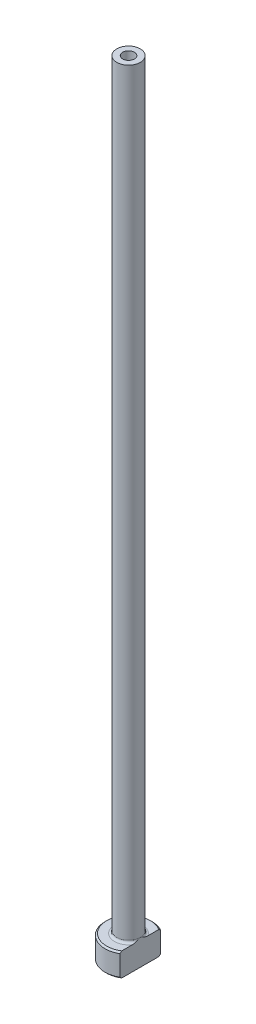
ISO-10303-21;
HEADER;
FILE_DESCRIPTION(('STEP AP214'),'2;1');
FILE_NAME('part.step','',(''),(''),'','','');
FILE_SCHEMA(('AUTOMOTIVE_DESIGN { 1 0 10303 214 1 1 1 1 }'));
ENDSEC;
DATA;
#1=APPLICATION_CONTEXT('core data for automotive mechanical design processes');
#2=APPLICATION_PROTOCOL_DEFINITION('international standard','automotive_design',2000,#1);
#3=PRODUCT_CONTEXT('',#1,'mechanical');
#4=PRODUCT('Part','Part','',(#3));
#5=PRODUCT_RELATED_PRODUCT_CATEGORY('part','',(#4));
#6=PRODUCT_DEFINITION_FORMATION('','',#4);
#7=PRODUCT_DEFINITION_CONTEXT('part definition',#1,'design');
#8=PRODUCT_DEFINITION('design','',#6,#7);
#9=PRODUCT_DEFINITION_SHAPE('','',#8);
#10=(LENGTH_UNIT() NAMED_UNIT(*) SI_UNIT(.MILLI.,.METRE.));
#11=(NAMED_UNIT(*) PLANE_ANGLE_UNIT() SI_UNIT($,.RADIAN.));
#12=(NAMED_UNIT(*) SI_UNIT($,.STERADIAN.) SOLID_ANGLE_UNIT());
#13=UNCERTAINTY_MEASURE_WITH_UNIT(LENGTH_MEASURE(1.E-05),#10,'distance_accuracy_value','');
#14=(GEOMETRIC_REPRESENTATION_CONTEXT(3) GLOBAL_UNCERTAINTY_ASSIGNED_CONTEXT((#13)) GLOBAL_UNIT_ASSIGNED_CONTEXT((#10,
#11,#12)) REPRESENTATION_CONTEXT('',''));
#15=CARTESIAN_POINT('',(0.,0.,0.));
#16=DIRECTION('',(0.,0.,1.));
#17=DIRECTION('',(1.,0.,0.));
#18=AXIS2_PLACEMENT_3D('',#15,#16,#17);
#19=CARTESIAN_POINT('',(0.,92.1876809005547,0.));
#20=DIRECTION('',(0.,1.,0.));
#21=DIRECTION('',(0.,0.,1.));
#22=AXIS2_PLACEMENT_3D('',#19,#20,#21);
#23=CYLINDRICAL_SURFACE('',#22,0.750000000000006);
#24=CARTESIAN_POINT('',(0.,100.,0.));
#25=DIRECTION('',(0.,1.,0.));
#26=DIRECTION('',(0.,0.,1.));
#27=AXIS2_PLACEMENT_3D('',#24,#25,#26);
#28=CIRCLE('',#27,0.750000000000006);
#29=CARTESIAN_POINT('',(0.,100.,0.750000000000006));
#30=VERTEX_POINT('',#29);
#31=EDGE_CURVE('E172',#30,#30,#28,.T.);
#32=ORIENTED_EDGE('',*,*,#31,.T.);
#33=EDGE_LOOP('',(#32));
#34=FACE_BOUND('',#33,.T.);
#35=CARTESIAN_POINT('',(0.,65.,0.));
#36=DIRECTION('',(0.,1.,0.));
#37=DIRECTION('',(0.,0.,1.));
#38=AXIS2_PLACEMENT_3D('',#35,#36,#37);
#39=CIRCLE('',#38,0.750000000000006);
#40=CARTESIAN_POINT('',(0.,65.,0.750000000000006));
#41=VERTEX_POINT('',#40);
#42=EDGE_CURVE('E175',#41,#41,#39,.T.);
#43=ORIENTED_EDGE('',*,*,#42,.F.);
#44=EDGE_LOOP('',(#43));
#45=FACE_BOUND('',#44,.T.);
#46=ADVANCED_FACE('F32',(#34,#45),#23,.F.);
#47=CARTESIAN_POINT('',(-0.750000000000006,100.,0.));
#48=DIRECTION('',(0.,1.,0.));
#49=DIRECTION('',(0.,0.,1.));
#50=AXIS2_PLACEMENT_3D('',#47,#48,#49);
#51=PLANE('',#50);
#52=CARTESIAN_POINT('',(0.,100.,0.));
#53=DIRECTION('',(0.,1.,0.));
#54=DIRECTION('',(0.,0.,1.));
#55=AXIS2_PLACEMENT_3D('',#52,#53,#54);
#56=CIRCLE('',#55,1.5);
#57=CARTESIAN_POINT('',(0.,100.,1.5));
#58=VERTEX_POINT('',#57);
#59=EDGE_CURVE('E179',#58,#58,#56,.T.);
#60=ORIENTED_EDGE('',*,*,#59,.T.);
#61=EDGE_LOOP('',(#60));
#62=FACE_BOUND('',#61,.T.);
#63=ORIENTED_EDGE('',*,*,#31,.F.);
#64=EDGE_LOOP('',(#63));
#65=FACE_BOUND('',#64,.T.);
#66=ADVANCED_FACE('F162',(#62,#65),#51,.T.);
#67=CARTESIAN_POINT('',(0.,92.1876809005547,0.));
#68=DIRECTION('',(0.,1.,0.));
#69=DIRECTION('',(0.,0.,1.));
#70=AXIS2_PLACEMENT_3D('',#67,#68,#69);
#71=CYLINDRICAL_SURFACE('',#70,1.49999999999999);
#72=CARTESIAN_POINT('',(0.,3.3,0.));
#73=DIRECTION('',(0.,1.,0.));
#74=DIRECTION('',(0.,0.,1.));
#75=AXIS2_PLACEMENT_3D('',#72,#73,#74);
#76=CIRCLE('',#75,1.49999999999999);
#77=CARTESIAN_POINT('',(1.49999999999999,3.3,0.));
#78=VERTEX_POINT('',#77);
#79=EDGE_CURVE('E187',#78,#78,#76,.T.);
#80=ORIENTED_EDGE('',*,*,#79,.T.);
#81=EDGE_LOOP('',(#80));
#82=FACE_BOUND('',#81,.T.);
#83=ORIENTED_EDGE('',*,*,#59,.F.);
#84=EDGE_LOOP('',(#83));
#85=FACE_BOUND('',#84,.T.);
#86=ADVANCED_FACE('F167',(#82,#85),#71,.T.);
#87=CARTESIAN_POINT('',(-1.49999999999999,3.,0.));
#88=DIRECTION('',(0.,1.,0.));
#89=DIRECTION('',(0.,0.,1.));
#90=AXIS2_PLACEMENT_3D('',#87,#88,#89);
#91=PLANE('',#90);
#92=DIRECTION('',(0.,0.,1.));
#93=VECTOR('',#92,1.);
#94=CARTESIAN_POINT('',(1.5,3.,0.));
#95=LINE('',#94,#93);
#96=CARTESIAN_POINT('',(1.5,3.,-2.36431808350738));
#97=VERTEX_POINT('',#96);
#98=CARTESIAN_POINT('',(1.5,3.,-0.994987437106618));
#99=VERTEX_POINT('',#98);
#100=EDGE_CURVE('E182',#97,#99,#95,.T.);
#101=ORIENTED_EDGE('',*,*,#100,.F.);
#102=CARTESIAN_POINT('',(0.,3.,0.));
#103=DIRECTION('',(0.,1.,0.));
#104=DIRECTION('',(0.,0.,1.));
#105=AXIS2_PLACEMENT_3D('',#102,#103,#104);
#106=CIRCLE('',#105,2.8);
#107=CARTESIAN_POINT('',(1.49999999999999,2.99999999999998,2.36431808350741));
#108=VERTEX_POINT('',#107);
#109=EDGE_CURVE('E193',#97,#108,#106,.T.);
#110=ORIENTED_EDGE('',*,*,#109,.T.);
#111=CARTESIAN_POINT('',(1.5,3.,0.994987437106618));
#112=VERTEX_POINT('',#111);
#113=EDGE_CURVE('E139',#112,#108,#95,.T.);
#114=ORIENTED_EDGE('',*,*,#113,.F.);
#115=CARTESIAN_POINT('',(0.,3.,0.));
#116=DIRECTION('',(0.,1.,0.));
#117=DIRECTION('',(0.,0.,1.));
#118=AXIS2_PLACEMENT_3D('',#115,#116,#117);
#119=CIRCLE('',#118,1.79999999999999);
#120=EDGE_CURVE('E190',#112,#99,#119,.F.);
#121=ORIENTED_EDGE('',*,*,#120,.T.);
#122=EDGE_LOOP('',(#101,#110,#114,#121));
#123=FACE_BOUND('',#122,.T.);
#124=ADVANCED_FACE('F208',(#123),#91,.T.);
#125=CARTESIAN_POINT('',(0.,92.1876809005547,0.));
#126=DIRECTION('',(0.,1.,0.));
#127=DIRECTION('',(0.,0.,1.));
#128=AXIS2_PLACEMENT_3D('',#125,#126,#127);
#129=CYLINDRICAL_SURFACE('',#128,2.99999999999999);
#130=DIRECTION('',(0.,-1.,0.));
#131=VECTOR('',#130,1.);
#132=CARTESIAN_POINT('',(1.49999999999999,100.,2.59807621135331));
#133=LINE('',#132,#131);
#134=CARTESIAN_POINT('',(1.49999999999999,2.8,2.59807621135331));
#135=VERTEX_POINT('',#134);
#136=CARTESIAN_POINT('',(1.49999999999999,0.20000000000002,2.59807621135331));
#137=VERTEX_POINT('',#136);
#138=EDGE_CURVE('E87',#135,#137,#133,.T.);
#139=ORIENTED_EDGE('',*,*,#138,.F.);
#140=CARTESIAN_POINT('',(0.,2.8,0.));
#141=DIRECTION('',(0.,1.,0.));
#142=DIRECTION('',(0.,0.,1.));
#143=AXIS2_PLACEMENT_3D('',#140,#141,#142);
#144=CIRCLE('',#143,2.99999999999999);
#145=CARTESIAN_POINT('',(1.5,2.8,-2.59807621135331));
#146=VERTEX_POINT('',#145);
#147=EDGE_CURVE('E100',#135,#146,#144,.F.);
#148=ORIENTED_EDGE('',*,*,#147,.T.);
#149=DIRECTION('',(0.,-1.,0.));
#150=VECTOR('',#149,1.);
#151=CARTESIAN_POINT('',(1.5,100.,-2.59807621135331));
#152=LINE('',#151,#150);
#153=CARTESIAN_POINT('',(1.5,0.20000000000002,-2.59807621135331));
#154=VERTEX_POINT('',#153);
#155=EDGE_CURVE('E199',#146,#154,#152,.T.);
#156=ORIENTED_EDGE('',*,*,#155,.T.);
#157=CARTESIAN_POINT('',(0.,0.20000000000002,0.));
#158=DIRECTION('',(0.,-1.,0.));
#159=DIRECTION('',(0.,0.,-1.));
#160=AXIS2_PLACEMENT_3D('',#157,#158,#159);
#161=CIRCLE('',#160,2.99999999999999);
#162=EDGE_CURVE('E103',#154,#137,#161,.F.);
#163=ORIENTED_EDGE('',*,*,#162,.T.);
#164=EDGE_LOOP('',(#139,#148,#156,#163));
#165=FACE_BOUND('',#164,.T.);
#166=ADVANCED_FACE('F197',(#165),#129,.T.);
#167=CARTESIAN_POINT('',(-2.99999999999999,0.,0.));
#168=DIRECTION('',(0.,-1.,0.));
#169=DIRECTION('',(0.,0.,-1.));
#170=AXIS2_PLACEMENT_3D('',#167,#168,#169);
#171=PLANE('',#170);
#172=DIRECTION('',(0.,0.,-1.));
#173=VECTOR('',#172,1.);
#174=CARTESIAN_POINT('',(1.49999999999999,0.,2.59807621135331));
#175=LINE('',#174,#173);
#176=CARTESIAN_POINT('',(1.49999999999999,0.,0.));
#177=VERTEX_POINT('',#176);
#178=CARTESIAN_POINT('',(1.5,0.,-2.36431808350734));
#179=VERTEX_POINT('',#178);
#180=EDGE_CURVE('E51',#177,#179,#175,.T.);
#181=ORIENTED_EDGE('',*,*,#180,.F.);
#182=CARTESIAN_POINT('',(0.,0.,0.));
#183=DIRECTION('',(0.,-1.,0.));
#184=DIRECTION('',(0.,0.,-1.));
#185=AXIS2_PLACEMENT_3D('',#182,#183,#184);
#186=CIRCLE('',#185,1.5);
#187=EDGE_CURVE('E40',#177,#177,#186,.F.);
#188=ORIENTED_EDGE('',*,*,#187,.T.);
#189=CARTESIAN_POINT('',(1.49999999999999,0.,2.36431808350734));
#190=VERTEX_POINT('',#189);
#191=EDGE_CURVE('E85',#190,#177,#175,.T.);
#192=ORIENTED_EDGE('',*,*,#191,.F.);
#193=CARTESIAN_POINT('',(0.,0.,0.));
#194=DIRECTION('',(0.,-1.,0.));
#195=DIRECTION('',(0.,0.,-1.));
#196=AXIS2_PLACEMENT_3D('',#193,#194,#195);
#197=CIRCLE('',#196,2.79999999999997);
#198=EDGE_CURVE('E97',#190,#179,#197,.T.);
#199=ORIENTED_EDGE('',*,*,#198,.T.);
#200=EDGE_LOOP('',(#181,#188,#192,#199));
#201=FACE_BOUND('',#200,.T.);
#202=ADVANCED_FACE('F96',(#201),#171,.T.);
#203=CARTESIAN_POINT('',(0.,92.1876809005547,0.));
#204=DIRECTION('',(0.,1.,0.));
#205=DIRECTION('',(0.,0.,1.));
#206=AXIS2_PLACEMENT_3D('',#203,#204,#205);
#207=CYLINDRICAL_SURFACE('',#206,0.999999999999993);
#208=CARTESIAN_POINT('',(0.,0.499999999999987,0.));
#209=DIRECTION('',(0.,-1.,0.));
#210=DIRECTION('',(0.,0.,-1.));
#211=AXIS2_PLACEMENT_3D('',#208,#209,#210);
#212=CIRCLE('',#211,0.999999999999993);
#213=CARTESIAN_POINT('',(0.,0.499999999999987,-0.999999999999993));
#214=VERTEX_POINT('',#213);
#215=EDGE_CURVE('E11',#214,#214,#212,.T.);
#216=ORIENTED_EDGE('',*,*,#215,.T.);
#217=EDGE_LOOP('',(#216));
#218=FACE_BOUND('',#217,.T.);
#219=CARTESIAN_POINT('',(0.,53.,0.));
#220=DIRECTION('',(0.,1.,0.));
#221=DIRECTION('',(0.,0.,1.));
#222=AXIS2_PLACEMENT_3D('',#219,#220,#221);
#223=CIRCLE('',#222,0.999999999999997);
#224=CARTESIAN_POINT('',(0.,53.,0.999999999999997));
#225=VERTEX_POINT('',#224);
#226=EDGE_CURVE('E177',#225,#225,#223,.T.);
#227=ORIENTED_EDGE('',*,*,#226,.T.);
#228=EDGE_LOOP('',(#227));
#229=FACE_BOUND('',#228,.T.);
#230=ADVANCED_FACE('F223',(#218,#229),#207,.F.);
#231=CARTESIAN_POINT('',(0.,53.,0.));
#232=DIRECTION('',(0.,-1.,0.));
#233=DIRECTION('',(0.,0.,-1.));
#234=AXIS2_PLACEMENT_3D('',#231,#232,#233);
#235=CONICAL_SURFACE('',#234,0.999999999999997,0.0208303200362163);
#236=ORIENTED_EDGE('',*,*,#42,.T.);
#237=EDGE_LOOP('',(#236));
#238=FACE_BOUND('',#237,.T.);
#239=ORIENTED_EDGE('',*,*,#226,.F.);
#240=EDGE_LOOP('',(#239));
#241=FACE_BOUND('',#240,.T.);
#242=ADVANCED_FACE('F116',(#238,#241),#235,.F.);
#243=CARTESIAN_POINT('',(0.,3.3,0.));
#244=DIRECTION('',(0.,1.,0.));
#245=DIRECTION('',(0.,0.,1.));
#246=AXIS2_PLACEMENT_3D('',#243,#244,#245);
#247=TOROIDAL_SURFACE('',#246,1.79999999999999,0.3);
#248=ORIENTED_EDGE('',*,*,#120,.F.);
#249=CARTESIAN_POINT('',(1.49999999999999,3.3,0.));
#250=CARTESIAN_POINT('',(1.49999999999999,3.30000063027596,-3.41902459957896E-12));
#251=CARTESIAN_POINT('',(1.49999999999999,3.30000126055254,1.1537363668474E-07));
#252=CARTESIAN_POINT('',(1.49999999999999,3.3000024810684,4.90631570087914E-07));
#253=CARTESIAN_POINT('',(1.49999999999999,3.30000307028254,7.5329666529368E-07));
#254=CARTESIAN_POINT('',(1.49999999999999,3.30000424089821,1.38757095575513E-06));
#255=CARTESIAN_POINT('',(1.49999999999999,3.30000481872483,1.76563000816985E-06));
#256=CARTESIAN_POINT('',(1.49999999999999,3.30000591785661,2.587680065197E-06));
#257=CARTESIAN_POINT('',(1.49999999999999,3.30000643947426,3.03127013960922E-06));
#258=CARTESIAN_POINT('',(1.49999999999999,3.30000815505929,4.60021967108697E-06));
#259=CARTESIAN_POINT('',(1.49999999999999,3.30000927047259,5.81241520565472E-06));
#260=CARTESIAN_POINT('',(1.49999999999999,3.3000112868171,8.33989414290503E-06));
#261=CARTESIAN_POINT('',(1.49999999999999,3.30001219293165,9.65128157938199E-06));
#262=CARTESIAN_POINT('',(1.49999999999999,3.30001551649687,1.46782505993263E-05));
#263=CARTESIAN_POINT('',(1.49999999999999,3.30001775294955,1.85179769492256E-05));
#264=CARTESIAN_POINT('',(1.49999999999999,3.30002148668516,2.61616194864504E-05));
#265=CARTESIAN_POINT('',(1.49999999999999,3.3000230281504,2.99447742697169E-05));
#266=CARTESIAN_POINT('',(1.49999999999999,3.30002943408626,4.58003744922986E-05));
#267=CARTESIAN_POINT('',(1.49999999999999,3.3000341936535,5.79079080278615E-05));
#268=CARTESIAN_POINT('',(1.49999999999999,3.30004197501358,8.07263758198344E-05));
#269=CARTESIAN_POINT('',(1.49999999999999,3.30004514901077,9.13834711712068E-05));
#270=CARTESIAN_POINT('',(1.49999999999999,3.30006989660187,0.000167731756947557));
#271=CARTESIAN_POINT('',(1.49999999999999,3.30010092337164,0.000229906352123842));
#272=CARTESIAN_POINT('',(1.49999999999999,3.30021632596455,0.000470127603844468));
#273=CARTESIAN_POINT('',(1.49999999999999,3.30029368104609,0.00065062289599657));
#274=CARTESIAN_POINT('',(1.49999999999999,3.30059619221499,0.00134589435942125));
#275=CARTESIAN_POINT('',(1.49999999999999,3.30082870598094,0.00185814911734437));
#276=CARTESIAN_POINT('',(1.49999999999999,3.30176696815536,0.00393547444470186));
#277=CARTESIAN_POINT('',(1.49999999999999,3.30246445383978,0.00550332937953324));
#278=CARTESIAN_POINT('',(1.49999999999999,3.31426785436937,0.0320229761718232));
#279=CARTESIAN_POINT('',(1.49999999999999,3.32544800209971,0.0569503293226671));
#280=CARTESIAN_POINT('',(1.49999999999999,3.34725700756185,0.105984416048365));
#281=CARTESIAN_POINT('',(1.49999999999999,3.35789134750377,0.130088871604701));
#282=CARTESIAN_POINT('',(1.49999999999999,3.38015321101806,0.181096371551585));
#283=CARTESIAN_POINT('',(1.49999999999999,3.39175804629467,0.208009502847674));
#284=CARTESIAN_POINT('',(1.49999999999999,3.41469034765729,0.262264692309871));
#285=CARTESIAN_POINT('',(1.49999999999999,3.4260139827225,0.28960836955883));
#286=CARTESIAN_POINT('',(1.49999999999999,3.45363212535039,0.358203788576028));
#287=CARTESIAN_POINT('',(1.49999999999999,3.46959026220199,0.39959288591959));
#288=CARTESIAN_POINT('',(1.49999999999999,3.49940505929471,0.482097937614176));
#289=CARTESIAN_POINT('',(1.49999999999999,3.51330033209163,0.523199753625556));
#290=CARTESIAN_POINT('',(1.49999999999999,3.53552507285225,0.595497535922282));
#291=CARTESIAN_POINT('',(1.49999999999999,3.54436834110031,0.626532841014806));
#292=CARTESIAN_POINT('',(1.49999999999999,3.56052427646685,0.689176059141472));
#293=CARTESIAN_POINT('',(1.49999999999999,3.56782794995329,0.720786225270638));
#294=CARTESIAN_POINT('',(1.49999999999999,3.58750752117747,0.819524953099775));
#295=CARTESIAN_POINT('',(1.49999999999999,3.59661044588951,0.887429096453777));
#296=CARTESIAN_POINT('',(1.49999999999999,3.60059842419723,0.991180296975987));
#297=CARTESIAN_POINT('',(1.49999999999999,3.60019840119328,1.02684364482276));
#298=CARTESIAN_POINT('',(1.49999999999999,3.59497085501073,1.09750559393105));
#299=CARTESIAN_POINT('',(1.49999999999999,3.59019295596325,1.13250716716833));
#300=CARTESIAN_POINT('',(1.49999999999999,3.57687734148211,1.19353096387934));
#301=CARTESIAN_POINT('',(1.49999999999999,3.56943875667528,1.21978854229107));
#302=CARTESIAN_POINT('',(1.49999999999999,3.55063748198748,1.27094658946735));
#303=CARTESIAN_POINT('',(1.49999999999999,3.53927342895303,1.2958465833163));
#304=CARTESIAN_POINT('',(1.49999999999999,3.51660016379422,1.33501873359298));
#305=CARTESIAN_POINT('',(1.49999999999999,3.50657738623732,1.35003296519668));
#306=CARTESIAN_POINT('',(1.49999999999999,3.48437469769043,1.37837252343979));
#307=CARTESIAN_POINT('',(1.49999999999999,3.47219867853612,1.39170082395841));
#308=CARTESIAN_POINT('',(1.49999999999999,3.44835614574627,1.41349417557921));
#309=CARTESIAN_POINT('',(1.49999999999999,3.43709185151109,1.42239673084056));
#310=CARTESIAN_POINT('',(1.49999999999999,3.41325256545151,1.43825467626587));
#311=CARTESIAN_POINT('',(1.49999999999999,3.40067804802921,1.44521076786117));
#312=CARTESIAN_POINT('',(1.49999999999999,3.37433767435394,1.45677158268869));
#313=CARTESIAN_POINT('',(1.49999999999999,3.36056203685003,1.46135438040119));
#314=CARTESIAN_POINT('',(1.49999999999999,3.33237324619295,1.46767730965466));
#315=CARTESIAN_POINT('',(1.49999999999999,3.31796076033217,1.46942034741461));
#316=CARTESIAN_POINT('',(1.49999999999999,3.2912247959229,1.46987207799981));
#317=CARTESIAN_POINT('',(1.49999999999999,3.27890664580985,1.46899029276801));
#318=CARTESIAN_POINT('',(1.49999999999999,3.25461019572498,1.46511570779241));
#319=CARTESIAN_POINT('',(1.49999999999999,3.24263187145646,1.46212305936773));
#320=CARTESIAN_POINT('',(1.49999999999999,3.21959683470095,1.45431173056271));
#321=CARTESIAN_POINT('',(1.49999999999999,3.20852542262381,1.44953579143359));
#322=CARTESIAN_POINT('',(1.49999999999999,3.18721125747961,1.43840957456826));
#323=CARTESIAN_POINT('',(1.49999999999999,3.17696878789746,1.4320587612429));
#324=CARTESIAN_POINT('',(1.49999999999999,3.15325976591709,1.41506353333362));
#325=CARTESIAN_POINT('',(1.49999999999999,3.14027750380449,1.40374235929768));
#326=CARTESIAN_POINT('',(1.49999999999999,3.11630720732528,1.37914825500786));
#327=CARTESIAN_POINT('',(1.49999999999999,3.10532420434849,1.36587054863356));
#328=CARTESIAN_POINT('',(1.49999999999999,3.08100891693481,1.33197272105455));
#329=CARTESIAN_POINT('',(1.49999999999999,3.06867625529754,1.31063843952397));
#330=CARTESIAN_POINT('',(1.49999999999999,3.04751867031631,1.26637455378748));
#331=CARTESIAN_POINT('',(1.49999999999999,3.03869240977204,1.24344556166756));
#332=CARTESIAN_POINT('',(1.49999999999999,3.01978360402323,1.1831653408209));
#333=CARTESIAN_POINT('',(1.49999999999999,3.01191472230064,1.14512623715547));
#334=CARTESIAN_POINT('',(1.49999999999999,3.00188285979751,1.0678997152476));
#335=CARTESIAN_POINT('',(1.49999999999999,2.99979735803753,1.02870374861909));
#336=CARTESIAN_POINT('',(1.49999999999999,3.00021727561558,0.953160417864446));
#337=CARTESIAN_POINT('',(1.49999999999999,3.00240673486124,0.91680871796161));
#338=CARTESIAN_POINT('',(1.49999999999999,3.00996433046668,0.844432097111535));
#339=CARTESIAN_POINT('',(1.49999999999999,3.01533462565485,0.808407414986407));
#340=CARTESIAN_POINT('',(1.49999999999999,3.02828086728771,0.738670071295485));
#341=CARTESIAN_POINT('',(1.49999999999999,3.0357302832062,0.704933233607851));
#342=CARTESIAN_POINT('',(1.49999999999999,3.05243174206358,0.638128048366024));
#343=CARTESIAN_POINT('',(1.49999999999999,3.06167285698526,0.605056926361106));
#344=CARTESIAN_POINT('',(1.49999999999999,3.08440652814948,0.530195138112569));
#345=CARTESIAN_POINT('',(1.49999999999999,3.09836576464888,0.488547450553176));
#346=CARTESIAN_POINT('',(1.49999999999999,3.12838209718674,0.404954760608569));
#347=CARTESIAN_POINT('',(1.49999999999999,3.14447968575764,0.363024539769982));
#348=CARTESIAN_POINT('',(1.49999999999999,3.17238454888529,0.29350899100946));
#349=CARTESIAN_POINT('',(1.49999999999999,3.18384249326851,0.2657815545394));
#350=CARTESIAN_POINT('',(1.49999999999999,3.20705854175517,0.21076947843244));
#351=CARTESIAN_POINT('',(1.49999999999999,3.21881265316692,0.183483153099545));
#352=CARTESIAN_POINT('',(1.49999999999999,3.24136702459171,0.131772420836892));
#353=CARTESIAN_POINT('',(1.49999999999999,3.25214361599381,0.107337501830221));
#354=CARTESIAN_POINT('',(1.49999999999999,3.2742474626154,0.0576321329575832));
#355=CARTESIAN_POINT('',(1.49999999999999,3.28558038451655,0.0323640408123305));
#356=CARTESIAN_POINT('',(1.49999999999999,3.2975355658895,0.0055032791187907));
#357=CARTESIAN_POINT('',(1.49999999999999,3.29823307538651,0.00393537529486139));
#358=CARTESIAN_POINT('',(1.49999999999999,3.29917134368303,0.00185803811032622));
#359=CARTESIAN_POINT('',(1.49999999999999,3.2994038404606,0.00134582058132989));
#360=CARTESIAN_POINT('',(1.49999999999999,3.29970633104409,0.000650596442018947));
#361=CARTESIAN_POINT('',(1.49999999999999,3.29978368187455,0.000470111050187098));
#362=CARTESIAN_POINT('',(1.49999999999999,3.29989907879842,0.000229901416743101));
#363=CARTESIAN_POINT('',(1.49999999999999,3.29993010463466,0.000167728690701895));
#364=CARTESIAN_POINT('',(1.49999999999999,3.29995485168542,9.1382569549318E-05));
#365=CARTESIAN_POINT('',(1.49999999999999,3.29995802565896,8.07256246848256E-05));
#366=CARTESIAN_POINT('',(1.49999999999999,3.29996580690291,5.79074825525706E-05));
#367=CARTESIAN_POINT('',(1.49999999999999,3.29997056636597,4.58001201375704E-05));
#368=CARTESIAN_POINT('',(1.49999999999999,3.29997697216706,2.99447122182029E-05));
#369=CARTESIAN_POINT('',(1.49999999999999,3.29997851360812,2.61615819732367E-05));
#370=CARTESIAN_POINT('',(1.49999999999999,3.29998224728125,1.85179847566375E-05));
#371=CARTESIAN_POINT('',(1.49999999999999,3.29998448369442,1.46782783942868E-05));
#372=CARTESIAN_POINT('',(1.49999999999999,3.29998780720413,9.65132765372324E-06));
#373=CARTESIAN_POINT('',(1.49999999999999,3.29998871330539,8.33994214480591E-06));
#374=CARTESIAN_POINT('',(1.49999999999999,3.29999072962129,5.81246437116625E-06));
#375=CARTESIAN_POINT('',(1.49999999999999,3.29999184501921,4.60026796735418E-06));
#376=CARTESIAN_POINT('',(1.49999999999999,3.29999356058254,3.03131401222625E-06));
#377=CARTESIAN_POINT('',(1.49999999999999,3.29999408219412,2.58772202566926E-06));
#378=CARTESIAN_POINT('',(1.49999999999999,3.29999518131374,1.76566706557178E-06));
#379=CARTESIAN_POINT('',(1.49999999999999,3.29999575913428,1.38760501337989E-06));
#380=CARTESIAN_POINT('',(1.49999999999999,3.29999692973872,7.53323454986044E-07));
#381=CARTESIAN_POINT('',(1.49999999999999,3.29999751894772,4.90654212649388E-07));
#382=CARTESIAN_POINT('',(1.49999999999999,3.29999873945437,1.15386277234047E-07));
#383=CARTESIAN_POINT('',(1.49999999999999,3.29999936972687,3.41925963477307E-12));
#384=CARTESIAN_POINT('',(1.49999999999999,3.3,0.));
#385=B_SPLINE_CURVE_WITH_KNOTS('',3,(#249,#250,#251,#252,#253,#254,#255,#256,#257,#258,#259,
#260,#261,#262,#263,#264,#265,#266,#267,#268,#269,#270,#271,#272,#273,#274,#275,#276,#277,#278,
#279,#280,#281,#282,#283,#284,#285,#286,#287,#288,#289,#290,#291,#292,#293,#294,#295,#296,#297,
#298,#299,#300,#301,#302,#303,#304,#305,#306,#307,#308,#309,#310,#311,#312,#313,#314,#315,#316,
#317,#318,#319,#320,#321,#322,#323,#324,#325,#326,#327,#328,#329,#330,#331,#332,#333,#334,#335,
#336,#337,#338,#339,#340,#341,#342,#343,#344,#345,#346,#347,#348,#349,#350,#351,#352,#353,#354,
#355,#356,#357,#358,#359,#360,#361,#362,#363,#364,#365,#366,#367,#368,#369,#370,#371,#372,#373,
#374,#375,#376,#377,#378,#379,#380,#381,#382,#383,#384),.UNSPECIFIED.,.T.,.F.,(4,2,2,2,2,2,2,2,
2,2,2,2,2,2,2,2,2,2,2,2,2,2,2,2,2,2,2,2,2,2,2,2,2,2,2,2,2,2,2,2,2,2,2,2,2,2,2,2,2,2,2,2,2,2,2,2,
2,2,2,2,2,2,2,2,2,2,2,4),(0.,1.88906031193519E-06,3.8150958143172E-06,5.87892822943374E-06,
7.93062005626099E-06,1.28480888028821E-05,1.76261714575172E-05,3.09099182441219E-05,
4.31529746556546E-05,8.21699327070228E-05,0.000115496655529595,0.000323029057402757,
0.000912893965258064,0.00259963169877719,0.00774858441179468,0.089697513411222,
0.168737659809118,0.256660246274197,0.345444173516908,0.47849253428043,0.608603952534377,
0.705372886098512,0.802692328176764,1.00719557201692,1.11399616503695,1.21960092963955,
1.30124317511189,1.38291380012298,1.43690814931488,1.49080588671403,1.53371524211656,
1.57660911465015,1.6198924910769,1.66313154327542,1.69999492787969,1.73685567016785,
1.7728844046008,1.80892540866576,1.86031324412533,1.91182866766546,1.98534297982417,
2.05882922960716,2.174717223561,2.29215041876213,2.40123170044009,2.51038710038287,
2.61397263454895,2.71694519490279,2.84866234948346,2.98337525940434,3.07337666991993,
3.162504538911,3.24262397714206,3.32569301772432,3.33084213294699,3.33252874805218,
3.33311858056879,3.33332610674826,3.33335943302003,3.33339844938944,3.33341069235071,
3.33342397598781,3.33342875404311,3.333433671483,3.33343572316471,3.33343778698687,
3.33343971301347,3.3334416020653),.UNSPECIFIED.);
#386=EDGE_CURVE('E131',#112,#78,#385,.T.);
#387=ORIENTED_EDGE('',*,*,#386,.T.);
#388=ORIENTED_EDGE('',*,*,#79,.F.);
#389=CARTESIAN_POINT('',(1.49999999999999,3.3,0.));
#390=CARTESIAN_POINT('',(1.49999999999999,3.29999936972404,3.41923718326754E-12));
#391=CARTESIAN_POINT('',(1.49999999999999,3.29999873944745,-1.1537363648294E-07));
#392=CARTESIAN_POINT('',(1.49999999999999,3.29999751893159,-4.9063156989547E-07));
#393=CARTESIAN_POINT('',(1.49999999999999,3.29999692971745,-7.53296665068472E-07));
#394=CARTESIAN_POINT('',(1.49999999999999,3.29999575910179,-1.38757095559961E-06));
#395=CARTESIAN_POINT('',(1.49999999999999,3.29999518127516,-1.76563000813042E-06));
#396=CARTESIAN_POINT('',(1.49999999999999,3.29999408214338,-2.58768006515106E-06));
#397=CARTESIAN_POINT('',(1.49999999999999,3.29999356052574,-3.03127013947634E-06));
#398=CARTESIAN_POINT('',(1.49999999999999,3.29999184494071,-4.6002196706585E-06));
#399=CARTESIAN_POINT('',(1.49999999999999,3.29999072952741,-5.8124152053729E-06));
#400=CARTESIAN_POINT('',(1.49999999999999,3.2999887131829,-8.33989414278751E-06));
#401=CARTESIAN_POINT('',(1.49999999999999,3.29998780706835,-9.65128157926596E-06));
#402=CARTESIAN_POINT('',(1.49999999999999,3.29998448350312,-1.46782505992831E-05));
#403=CARTESIAN_POINT('',(1.49999999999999,3.29998224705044,-1.85179769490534E-05));
#404=CARTESIAN_POINT('',(1.49999999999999,3.29997851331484,-2.61616194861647E-05));
#405=CARTESIAN_POINT('',(1.49999999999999,3.29997697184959,-2.99447742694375E-05));
#406=CARTESIAN_POINT('',(1.49999999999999,3.29997056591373,-4.58003744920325E-05));
#407=CARTESIAN_POINT('',(1.49999999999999,3.29996580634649,-5.79079080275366E-05));
#408=CARTESIAN_POINT('',(1.49999999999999,3.29995802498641,-8.07263758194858E-05));
#409=CARTESIAN_POINT('',(1.49999999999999,3.29995485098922,-9.13834711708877E-05));
#410=CARTESIAN_POINT('',(1.49999999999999,3.29993010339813,-0.000167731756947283));
#411=CARTESIAN_POINT('',(1.49999999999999,3.29989907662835,-0.000229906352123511));
#412=CARTESIAN_POINT('',(1.49999999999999,3.29978367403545,-0.000470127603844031));
#413=CARTESIAN_POINT('',(1.49999999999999,3.29970631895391,-0.000650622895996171));
#414=CARTESIAN_POINT('',(1.49999999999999,3.299403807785,-0.00134589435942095));
#415=CARTESIAN_POINT('',(1.49999999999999,3.29917129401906,-0.00185814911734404));
#416=CARTESIAN_POINT('',(1.49999999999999,3.29823303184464,-0.00393547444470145));
#417=CARTESIAN_POINT('',(1.49999999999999,3.29753554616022,-0.00550332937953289));
#418=CARTESIAN_POINT('',(1.49999999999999,3.28573214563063,-0.0320229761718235));
#419=CARTESIAN_POINT('',(1.49999999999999,3.27455199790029,-0.0569503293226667));
#420=CARTESIAN_POINT('',(1.49999999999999,3.25274299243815,-0.105984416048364));
#421=CARTESIAN_POINT('',(1.49999999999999,3.24210865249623,-0.130088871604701));
#422=CARTESIAN_POINT('',(1.49999999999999,3.21984678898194,-0.181096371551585));
#423=CARTESIAN_POINT('',(1.49999999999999,3.20824195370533,-0.208009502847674));
#424=CARTESIAN_POINT('',(1.49999999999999,3.1853096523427,-0.26226469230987));
#425=CARTESIAN_POINT('',(1.49999999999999,3.1739860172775,-0.289608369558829));
#426=CARTESIAN_POINT('',(1.49999999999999,3.1463678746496,-0.358203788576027));
#427=CARTESIAN_POINT('',(1.49999999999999,3.130409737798,-0.399592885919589));
#428=CARTESIAN_POINT('',(1.49999999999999,3.10059494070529,-0.482097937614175));
#429=CARTESIAN_POINT('',(1.49999999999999,3.08669966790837,-0.523199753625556));
#430=CARTESIAN_POINT('',(1.49999999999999,3.06447492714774,-0.595497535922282));
#431=CARTESIAN_POINT('',(1.49999999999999,3.05563165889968,-0.626532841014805));
#432=CARTESIAN_POINT('',(1.49999999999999,3.03947572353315,-0.689176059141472));
#433=CARTESIAN_POINT('',(1.49999999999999,3.03217205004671,-0.720786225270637));
#434=CARTESIAN_POINT('',(1.49999999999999,3.01249247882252,-0.819524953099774));
#435=CARTESIAN_POINT('',(1.49999999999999,3.00338955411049,-0.887429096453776));
#436=CARTESIAN_POINT('',(1.49999999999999,2.99940157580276,-0.991180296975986));
#437=CARTESIAN_POINT('',(1.49999999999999,2.99980159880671,-1.02684364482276));
#438=CARTESIAN_POINT('',(1.49999999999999,3.00502914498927,-1.09750559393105));
#439=CARTESIAN_POINT('',(1.49999999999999,3.00980704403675,-1.13250716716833));
#440=CARTESIAN_POINT('',(1.49999999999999,3.02312265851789,-1.19353096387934));
#441=CARTESIAN_POINT('',(1.49999999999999,3.03056124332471,-1.21978854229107));
#442=CARTESIAN_POINT('',(1.49999999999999,3.04936251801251,-1.27094658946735));
#443=CARTESIAN_POINT('',(1.5,3.06072657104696,-1.2958465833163));
#444=CARTESIAN_POINT('',(1.5,3.08339983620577,-1.33501873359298));
#445=CARTESIAN_POINT('',(1.5,3.09342261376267,-1.35003296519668));
#446=CARTESIAN_POINT('',(1.5,3.11562530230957,-1.37837252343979));
#447=CARTESIAN_POINT('',(1.5,3.12780132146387,-1.39170082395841));
#448=CARTESIAN_POINT('',(1.5,3.15164385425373,-1.41349417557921));
#449=CARTESIAN_POINT('',(1.5,3.1629081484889,-1.42239673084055));
#450=CARTESIAN_POINT('',(1.5,3.18674743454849,-1.43825467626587));
#451=CARTESIAN_POINT('',(1.5,3.19932195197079,-1.44521076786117));
#452=CARTESIAN_POINT('',(1.5,3.22566232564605,-1.45677158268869));
#453=CARTESIAN_POINT('',(1.5,3.23943796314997,-1.46135438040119));
#454=CARTESIAN_POINT('',(1.5,3.26762675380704,-1.46767730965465));
#455=CARTESIAN_POINT('',(1.5,3.28203923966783,-1.46942034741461));
#456=CARTESIAN_POINT('',(1.5,3.30877520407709,-1.46987207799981));
#457=CARTESIAN_POINT('',(1.5,3.32109335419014,-1.46899029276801));
#458=CARTESIAN_POINT('',(1.5,3.34538980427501,-1.46511570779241));
#459=CARTESIAN_POINT('',(1.5,3.35736812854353,-1.46212305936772));
#460=CARTESIAN_POINT('',(1.5,3.38040316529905,-1.45431173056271));
#461=CARTESIAN_POINT('',(1.5,3.39147457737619,-1.44953579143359));
#462=CARTESIAN_POINT('',(1.5,3.41278874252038,-1.43840957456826));
#463=CARTESIAN_POINT('',(1.5,3.42303121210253,-1.4320587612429));
#464=CARTESIAN_POINT('',(1.5,3.44674023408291,-1.41506353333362));
#465=CARTESIAN_POINT('',(1.5,3.45972249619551,-1.40374235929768));
#466=CARTESIAN_POINT('',(1.5,3.48369279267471,-1.37914825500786));
#467=CARTESIAN_POINT('',(1.5,3.4946757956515,-1.36587054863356));
#468=CARTESIAN_POINT('',(1.5,3.51899108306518,-1.33197272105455));
#469=CARTESIAN_POINT('',(1.49999999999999,3.53132374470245,-1.31063843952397));
#470=CARTESIAN_POINT('',(1.49999999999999,3.55248132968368,-1.26637455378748));
#471=CARTESIAN_POINT('',(1.49999999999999,3.56130759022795,-1.24344556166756));
#472=CARTESIAN_POINT('',(1.49999999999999,3.58021639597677,-1.1831653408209));
#473=CARTESIAN_POINT('',(1.49999999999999,3.58808527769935,-1.14512623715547));
#474=CARTESIAN_POINT('',(1.49999999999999,3.59811714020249,-1.0678997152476));
#475=CARTESIAN_POINT('',(1.49999999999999,3.60020264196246,-1.02870374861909));
#476=CARTESIAN_POINT('',(1.49999999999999,3.59978272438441,-0.953160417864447));
#477=CARTESIAN_POINT('',(1.49999999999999,3.59759326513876,-0.916808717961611));
#478=CARTESIAN_POINT('',(1.49999999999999,3.59003566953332,-0.844432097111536));
#479=CARTESIAN_POINT('',(1.49999999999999,3.58466537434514,-0.808407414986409));
#480=CARTESIAN_POINT('',(1.49999999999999,3.57171913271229,-0.738670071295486));
#481=CARTESIAN_POINT('',(1.49999999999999,3.5642697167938,-0.704933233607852));
#482=CARTESIAN_POINT('',(1.49999999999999,3.54756825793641,-0.638128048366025));
#483=CARTESIAN_POINT('',(1.49999999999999,3.53832714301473,-0.605056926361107));
#484=CARTESIAN_POINT('',(1.49999999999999,3.51559347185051,-0.53019513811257));
#485=CARTESIAN_POINT('',(1.49999999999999,3.50163423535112,-0.488547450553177));
#486=CARTESIAN_POINT('',(1.49999999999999,3.47161790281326,-0.404954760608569));
#487=CARTESIAN_POINT('',(1.49999999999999,3.45552031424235,-0.363024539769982));
#488=CARTESIAN_POINT('',(1.49999999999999,3.4276154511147,-0.29350899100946));
#489=CARTESIAN_POINT('',(1.49999999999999,3.41615750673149,-0.265781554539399));
#490=CARTESIAN_POINT('',(1.49999999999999,3.39294145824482,-0.21076947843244));
#491=CARTESIAN_POINT('',(1.49999999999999,3.38118734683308,-0.183483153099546));
#492=CARTESIAN_POINT('',(1.49999999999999,3.35863297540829,-0.131772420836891));
#493=CARTESIAN_POINT('',(1.49999999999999,3.34785638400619,-0.107337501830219));
#494=CARTESIAN_POINT('',(1.49999999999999,3.32575253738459,-0.0576321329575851));
#495=CARTESIAN_POINT('',(1.49999999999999,3.31441961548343,-0.0323640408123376));
#496=CARTESIAN_POINT('',(1.49999999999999,3.30246443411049,-0.00550327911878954));
#497=CARTESIAN_POINT('',(1.49999999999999,3.30176692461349,-0.00393537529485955));
#498=CARTESIAN_POINT('',(1.49999999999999,3.30082865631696,-0.00185803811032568));
#499=CARTESIAN_POINT('',(1.49999999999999,3.30059615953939,-0.00134582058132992));
#500=CARTESIAN_POINT('',(1.49999999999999,3.30029366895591,-0.000650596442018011));
#501=CARTESIAN_POINT('',(1.49999999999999,3.30021631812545,-0.000470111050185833));
#502=CARTESIAN_POINT('',(1.49999999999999,3.30010092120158,-0.000229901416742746));
#503=CARTESIAN_POINT('',(1.49999999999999,3.30006989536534,-0.000167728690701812));
#504=CARTESIAN_POINT('',(1.49999999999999,3.30004514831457,-9.13825695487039E-05));
#505=CARTESIAN_POINT('',(1.49999999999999,3.30004197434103,-8.07256246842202E-05));
#506=CARTESIAN_POINT('',(1.49999999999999,3.30003419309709,-5.79074825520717E-05));
#507=CARTESIAN_POINT('',(1.49999999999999,3.30002943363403,-4.58001201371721E-05));
#508=CARTESIAN_POINT('',(1.49999999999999,3.30002302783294,-2.99447122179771E-05));
#509=CARTESIAN_POINT('',(1.49999999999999,3.30002148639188,-2.61615819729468E-05));
#510=CARTESIAN_POINT('',(1.49999999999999,3.30001775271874,-1.85179847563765E-05));
#511=CARTESIAN_POINT('',(1.49999999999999,3.30001551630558,-1.46782783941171E-05));
#512=CARTESIAN_POINT('',(1.49999999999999,3.30001219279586,-9.65132765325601E-06));
#513=CARTESIAN_POINT('',(1.49999999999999,3.3000112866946,-8.3399421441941E-06));
#514=CARTESIAN_POINT('',(1.49999999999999,3.3000092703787,-5.81246437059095E-06));
#515=CARTESIAN_POINT('',(1.49999999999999,3.30000815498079,-4.60026796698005E-06));
#516=CARTESIAN_POINT('',(1.49999999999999,3.30000643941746,-3.0313140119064E-06));
#517=CARTESIAN_POINT('',(1.49999999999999,3.30000591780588,-2.58772202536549E-06));
#518=CARTESIAN_POINT('',(1.49999999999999,3.30000481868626,-1.76566706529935E-06));
#519=CARTESIAN_POINT('',(1.49999999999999,3.30000424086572,-1.3876050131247E-06));
#520=CARTESIAN_POINT('',(1.49999999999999,3.30000307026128,-7.53323454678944E-07));
#521=CARTESIAN_POINT('',(1.49999999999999,3.30000248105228,-4.90654212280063E-07));
#522=CARTESIAN_POINT('',(1.49999999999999,3.30000126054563,-1.15386276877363E-07));
#523=CARTESIAN_POINT('',(1.49999999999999,3.30000063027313,-3.41897144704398E-12));
#524=CARTESIAN_POINT('',(1.49999999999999,3.3,0.));
#525=B_SPLINE_CURVE_WITH_KNOTS('',3,(#389,#390,#391,#392,#393,#394,#395,#396,#397,#398,#399,
#400,#401,#402,#403,#404,#405,#406,#407,#408,#409,#410,#411,#412,#413,#414,#415,#416,#417,#418,
#419,#420,#421,#422,#423,#424,#425,#426,#427,#428,#429,#430,#431,#432,#433,#434,#435,#436,#437,
#438,#439,#440,#441,#442,#443,#444,#445,#446,#447,#448,#449,#450,#451,#452,#453,#454,#455,#456,
#457,#458,#459,#460,#461,#462,#463,#464,#465,#466,#467,#468,#469,#470,#471,#472,#473,#474,#475,
#476,#477,#478,#479,#480,#481,#482,#483,#484,#485,#486,#487,#488,#489,#490,#491,#492,#493,#494,
#495,#496,#497,#498,#499,#500,#501,#502,#503,#504,#505,#506,#507,#508,#509,#510,#511,#512,#513,
#514,#515,#516,#517,#518,#519,#520,#521,#522,#523,#524),.UNSPECIFIED.,.T.,.F.,(4,2,2,2,2,2,2,2,
2,2,2,2,2,2,2,2,2,2,2,2,2,2,2,2,2,2,2,2,2,2,2,2,2,2,2,2,2,2,2,2,2,2,2,2,2,2,2,2,2,2,2,2,2,2,2,2,
2,2,2,2,2,2,2,2,2,2,2,4),(0.,1.88906031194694E-06,3.81509581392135E-06,5.87892822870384E-06,
7.93062005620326E-06,1.28480888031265E-05,1.7626171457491E-05,3.0909918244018E-05,
4.315297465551E-05,8.21699327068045E-05,0.00011549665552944,0.000323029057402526,
0.000912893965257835,0.00259963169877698,0.00774858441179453,0.0896975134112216,
0.168737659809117,0.256660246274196,0.345444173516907,0.478492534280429,0.608603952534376,
0.705372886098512,0.802692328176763,1.00719557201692,1.11399616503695,1.21960092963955,
1.30124317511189,1.38291380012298,1.43690814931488,1.49080588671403,1.53371524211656,
1.57660911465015,1.6198924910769,1.66313154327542,1.69999492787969,1.73685567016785,
1.7728844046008,1.80892540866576,1.86031324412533,1.91182866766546,1.98534297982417,
2.05882922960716,2.174717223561,2.29215041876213,2.40123170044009,2.51038710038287,
2.61397263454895,2.71694519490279,2.84866234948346,2.98337525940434,3.07337666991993,
3.162504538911,3.24262397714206,3.32569301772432,3.33084213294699,3.33252874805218,
3.33311858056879,3.33332610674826,3.33335943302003,3.33339844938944,3.33341069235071,
3.33342397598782,3.33342875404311,3.333433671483,3.33343572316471,3.33343778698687,
3.33343971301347,3.3334416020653),.UNSPECIFIED.);
#526=EDGE_CURVE('E140',#78,#99,#525,.T.);
#527=ORIENTED_EDGE('',*,*,#526,.T.);
#528=EDGE_LOOP('',(#248,#387,#388,#527));
#529=FACE_BOUND('',#528,.T.);
#530=ADVANCED_FACE('F146',(#529),#247,.F.);
#531=CARTESIAN_POINT('',(0.,3.,0.));
#532=DIRECTION('',(0.,-1.,0.));
#533=DIRECTION('',(0.,0.,-1.));
#534=AXIS2_PLACEMENT_3D('',#531,#532,#533);
#535=CONICAL_SURFACE('',#534,2.8,0.785398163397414);
#536=CARTESIAN_POINT('',(1.5,-0.111741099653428,-5.71827621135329));
#537=CARTESIAN_POINT('',(1.5,0.0136183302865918,-5.58866816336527));
#538=CARTESIAN_POINT('',(1.5,0.13884324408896,-5.45892957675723));
#539=CARTESIAN_POINT('',(1.5,0.388944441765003,-5.19911365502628));
#540=CARTESIAN_POINT('',(1.5,0.513820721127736,-5.06903631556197));
#541=CARTESIAN_POINT('',(1.5,0.763205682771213,-4.80840180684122));
#542=CARTESIAN_POINT('',(1.5,0.887714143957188,-4.67784442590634));
#543=CARTESIAN_POINT('',(1.5,1.13618059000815,-4.41620813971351));
#544=CARTESIAN_POINT('',(1.5,1.26013857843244,-4.28512923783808));
#545=CARTESIAN_POINT('',(1.5,1.50488975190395,-4.02490837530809));
#546=CARTESIAN_POINT('',(1.5,1.62569693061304,-3.89577958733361));
#547=CARTESIAN_POINT('',(1.5,1.86640694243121,-3.63668213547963));
#548=CARTESIAN_POINT('',(1.5,1.98630978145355,-3.50671347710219));
#549=CARTESIAN_POINT('',(1.5,2.22486033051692,-3.24567921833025));
#550=CARTESIAN_POINT('',(1.5,2.34350830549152,-3.11461386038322));
#551=CARTESIAN_POINT('',(1.5,2.57907716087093,-2.85094268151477));
#552=CARTESIAN_POINT('',(1.5,2.69599811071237,-2.71833692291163));
#553=CARTESIAN_POINT('',(1.5,2.88262371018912,-2.50255231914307));
#554=CARTESIAN_POINT('',(1.5,2.95312454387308,-2.42006293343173));
#555=CARTESIAN_POINT('',(1.5,3.09287098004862,-2.254010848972));
#556=CARTESIAN_POINT('',(1.5,3.16211645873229,-2.17044804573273));
#557=CARTESIAN_POINT('',(1.5,3.29964684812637,-2.00105967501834));
#558=CARTESIAN_POINT('',(1.5,3.36791386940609,-1.9152195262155));
#559=CARTESIAN_POINT('',(1.5,3.50205840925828,-1.7417139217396));
#560=CARTESIAN_POINT('',(1.5,3.56793649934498,-1.65404891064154));
#561=CARTESIAN_POINT('',(1.5,3.69728151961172,-1.47490236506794));
#562=CARTESIAN_POINT('',(1.49999999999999,3.76069661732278,-1.38338308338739));
#563=CARTESIAN_POINT('',(1.49999999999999,3.88239539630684,-1.19675661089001));
#564=CARTESIAN_POINT('',(1.49999999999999,3.94067201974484,-1.10164473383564));
#565=CARTESIAN_POINT('',(1.49999999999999,4.04841325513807,-0.908008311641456));
#566=CARTESIAN_POINT('',(1.49999999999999,4.09797809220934,-0.809540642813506));
#567=CARTESIAN_POINT('',(1.49999999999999,4.1843218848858,-0.607192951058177));
#568=CARTESIAN_POINT('',(1.49999999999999,4.22114374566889,-0.503332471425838));
#569=CARTESIAN_POINT('',(1.49999999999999,4.26099935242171,-0.347577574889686));
#570=CARTESIAN_POINT('',(1.49999999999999,4.27157029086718,-0.297609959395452));
#571=CARTESIAN_POINT('',(1.49999999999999,4.28794860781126,-0.19688506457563));
#572=CARTESIAN_POINT('',(1.49999999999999,4.29375640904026,-0.14612785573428));
#573=CARTESIAN_POINT('',(1.49999999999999,4.30019707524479,-0.0444388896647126));
#574=CARTESIAN_POINT('',(1.49999999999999,4.30084594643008,0.00649183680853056));
#575=CARTESIAN_POINT('',(1.49999999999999,4.29696416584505,0.108155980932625));
#576=CARTESIAN_POINT('',(1.49999999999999,4.29243308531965,0.158889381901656));
#577=CARTESIAN_POINT('',(1.49999999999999,4.27856915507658,0.259234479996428));
#578=CARTESIAN_POINT('',(1.49999999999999,4.26927821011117,0.308852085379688));
#579=CARTESIAN_POINT('',(1.49999999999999,4.24647108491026,0.407110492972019));
#580=CARTESIAN_POINT('',(1.49999999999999,4.23295324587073,0.455750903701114));
#581=CARTESIAN_POINT('',(1.49999999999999,4.20226175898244,0.552149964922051));
#582=CARTESIAN_POINT('',(1.49999999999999,4.18506801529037,0.599902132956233));
#583=CARTESIAN_POINT('',(1.49999999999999,4.14771387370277,0.694205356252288));
#584=CARTESIAN_POINT('',(1.49999999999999,4.12755408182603,0.740756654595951));
#585=CARTESIAN_POINT('',(1.49999999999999,4.06327696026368,0.879166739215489));
#586=CARTESIAN_POINT('',(1.49999999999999,4.01551721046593,0.969329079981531));
#587=CARTESIAN_POINT('',(1.49999999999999,3.91367909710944,1.14604316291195));
#588=CARTESIAN_POINT('',(1.49999999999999,3.85959300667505,1.23259031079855));
#589=CARTESIAN_POINT('',(1.49999999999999,3.74697968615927,1.4032134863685));
#590=CARTESIAN_POINT('',(1.49999999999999,3.68843573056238,1.48727838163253));
#591=CARTESIAN_POINT('',(1.49999999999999,3.56843845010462,1.65322187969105));
#592=CARTESIAN_POINT('',(1.49999999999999,3.50698656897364,1.73510153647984));
#593=CARTESIAN_POINT('',(1.49999999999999,3.38115673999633,1.89829823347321));
#594=CARTESIAN_POINT('',(1.49999999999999,3.31675092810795,1.97959369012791));
#595=CARTESIAN_POINT('',(1.49999999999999,3.18634068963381,2.14090082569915));
#596=CARTESIAN_POINT('',(1.49999999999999,3.12033609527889,2.22091236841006));
#597=CARTESIAN_POINT('',(1.49999999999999,2.92086431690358,2.4590650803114));
#598=CARTESIAN_POINT('',(1.49999999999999,2.78562663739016,2.61572090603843));
#599=CARTESIAN_POINT('',(1.49999999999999,2.53554498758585,2.90006295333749));
#600=CARTESIAN_POINT('',(1.49999999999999,2.42114543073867,3.02814382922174));
#601=CARTESIAN_POINT('',(1.49999999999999,2.19093557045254,3.28303767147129));
#602=CARTESIAN_POINT('',(1.49999999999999,2.07512522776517,3.40985060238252));
#603=CARTESIAN_POINT('',(1.49999999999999,1.72597067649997,3.78913849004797));
#604=CARTESIAN_POINT('',(1.49999999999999,1.4911176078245,4.04022177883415));
#605=CARTESIAN_POINT('',(1.49999999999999,1.02882478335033,4.52992803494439));
#606=CARTESIAN_POINT('',(1.49999999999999,0.801477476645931,4.76863870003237));
#607=CARTESIAN_POINT('',(1.49999999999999,0.459548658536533,5.125580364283));
#608=CARTESIAN_POINT('',(1.49999999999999,0.345484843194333,5.24430773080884));
#609=CARTESIAN_POINT('',(1.49999999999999,0.117071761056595,5.48148573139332));
#610=CARTESIAN_POINT('',(1.49999999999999,0.00272249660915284,5.59993636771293));
#611=CARTESIAN_POINT('',(1.49999999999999,-0.111741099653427,5.71827621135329));
#612=B_SPLINE_CURVE_WITH_KNOTS('',3,(#536,#537,#538,#539,#540,#541,#542,#543,#544,#545,#546,
#547,#548,#549,#550,#551,#552,#553,#554,#555,#556,#557,#558,#559,#560,#561,#562,#563,#564,#565,
#566,#567,#568,#569,#570,#571,#572,#573,#574,#575,#576,#577,#578,#579,#580,#581,#582,#583,#584,
#585,#586,#587,#588,#589,#590,#591,#592,#593,#594,#595,#596,#597,#598,#599,#600,#601,#602,#603,
#604,#605,#606,#607,#608,#609,#610,#611),.UNSPECIFIED.,.F.,.F.,(4,2,2,2,2,2,2,2,2,2,2,2,2,2,2,2,
2,2,2,2,2,2,2,2,2,2,2,2,2,2,2,2,2,2,2,2,2,4),(0.,0.540943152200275,1.08189327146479,
1.62312052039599,2.16434426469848,2.69482920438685,3.22531067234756,3.75567781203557,
4.28602356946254,4.61155053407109,4.9371094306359,5.26610945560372,5.59503024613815,
5.92894782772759,6.26331713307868,6.59354403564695,6.92264800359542,7.07567478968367,
7.22868799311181,7.38122626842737,7.53377717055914,7.68500755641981,7.83629736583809,
7.98843643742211,8.14054446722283,8.44618799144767,8.75220879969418,9.05944044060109,
9.3665211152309,9.67764287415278,9.98879742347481,10.6095925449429,11.1247803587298,
11.6399825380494,12.6713544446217,13.6603005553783,14.1542238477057,14.648143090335),.UNSPECIFIED.);
#613=EDGE_CURVE('E138',#146,#97,#612,.T.);
#614=ORIENTED_EDGE('',*,*,#613,.F.);
#615=ORIENTED_EDGE('',*,*,#147,.F.);
#616=EDGE_CURVE('E123',#108,#135,#612,.T.);
#617=ORIENTED_EDGE('',*,*,#616,.F.);
#618=ORIENTED_EDGE('',*,*,#109,.F.);
#619=EDGE_LOOP('',(#614,#615,#617,#618));
#620=FACE_BOUND('',#619,.T.);
#621=ADVANCED_FACE('F150',(#620),#535,.T.);
#622=CARTESIAN_POINT('',(0.,0.20000000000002,0.));
#623=DIRECTION('',(0.,1.,0.));
#624=DIRECTION('',(0.,0.,1.));
#625=AXIS2_PLACEMENT_3D('',#622,#623,#624);
#626=CONICAL_SURFACE('',#625,2.99999999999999,0.785398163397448);
#627=CARTESIAN_POINT('',(1.49999999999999,3.11174109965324,5.71827621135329));
#628=CARTESIAN_POINT('',(1.49999999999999,2.98638166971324,5.58866816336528));
#629=CARTESIAN_POINT('',(1.49999999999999,2.86115675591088,5.45892957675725));
#630=CARTESIAN_POINT('',(1.49999999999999,2.61105555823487,5.1991136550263));
#631=CARTESIAN_POINT('',(1.49999999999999,2.48617927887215,5.06903631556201));
#632=CARTESIAN_POINT('',(1.49999999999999,2.2367943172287,4.80840180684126));
#633=CARTESIAN_POINT('',(1.49999999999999,2.11228585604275,4.67784442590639));
#634=CARTESIAN_POINT('',(1.49999999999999,1.86381940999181,4.41620813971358));
#635=CARTESIAN_POINT('',(1.49999999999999,1.73986142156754,4.28512923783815));
#636=CARTESIAN_POINT('',(1.49999999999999,1.49511024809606,4.02490837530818));
#637=CARTESIAN_POINT('',(1.49999999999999,1.37430306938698,3.8957795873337));
#638=CARTESIAN_POINT('',(1.49999999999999,1.13359305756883,3.63668213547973));
#639=CARTESIAN_POINT('',(1.49999999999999,1.01369021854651,3.50671347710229));
#640=CARTESIAN_POINT('',(1.49999999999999,0.775139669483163,3.24567921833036));
#641=CARTESIAN_POINT('',(1.49999999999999,0.65649169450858,3.11461386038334));
#642=CARTESIAN_POINT('',(1.49999999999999,0.420922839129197,2.85094268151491));
#643=CARTESIAN_POINT('',(1.49999999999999,0.304001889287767,2.71833692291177));
#644=CARTESIAN_POINT('',(1.49999999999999,0.117376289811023,2.50255231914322));
#645=CARTESIAN_POINT('',(1.49999999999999,0.0468754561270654,2.42006293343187));
#646=CARTESIAN_POINT('',(1.49999999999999,-0.0928709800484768,2.25401084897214));
#647=CARTESIAN_POINT('',(1.49999999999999,-0.162116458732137,2.17044804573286));
#648=CARTESIAN_POINT('',(1.49999999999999,-0.299646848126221,2.00105967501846));
#649=CARTESIAN_POINT('',(1.49999999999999,-0.367913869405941,1.91521952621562));
#650=CARTESIAN_POINT('',(1.49999999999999,-0.502058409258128,1.74171392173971));
#651=CARTESIAN_POINT('',(1.49999999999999,-0.56793649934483,1.65404891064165));
#652=CARTESIAN_POINT('',(1.49999999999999,-0.697281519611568,1.47490236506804));
#653=CARTESIAN_POINT('',(1.49999999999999,-0.760696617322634,1.38338308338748));
#654=CARTESIAN_POINT('',(1.49999999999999,-0.882395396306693,1.1967566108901));
#655=CARTESIAN_POINT('',(1.49999999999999,-0.940672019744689,1.10164473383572));
#656=CARTESIAN_POINT('',(1.49999999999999,-1.04841325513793,0.908008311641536));
#657=CARTESIAN_POINT('',(1.49999999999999,-1.0979780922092,0.809540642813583));
#658=CARTESIAN_POINT('',(1.49999999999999,-1.18432188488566,0.607192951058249));
#659=CARTESIAN_POINT('',(1.49999999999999,-1.22114374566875,0.503332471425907));
#660=CARTESIAN_POINT('',(1.49999999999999,-1.26099935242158,0.347577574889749));
#661=CARTESIAN_POINT('',(1.49999999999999,-1.27157029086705,0.29760995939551));
#662=CARTESIAN_POINT('',(1.49999999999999,-1.28794860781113,0.196885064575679));
#663=CARTESIAN_POINT('',(1.49999999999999,-1.29375640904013,0.146127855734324));
#664=CARTESIAN_POINT('',(1.49999999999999,-1.30019707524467,0.0444388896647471));
#665=CARTESIAN_POINT('',(1.49999999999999,-1.30084594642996,-0.00649183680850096));
#666=CARTESIAN_POINT('',(1.49999999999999,-1.29696416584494,-0.108155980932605));
#667=CARTESIAN_POINT('',(1.49999999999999,-1.29243308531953,-0.158889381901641));
#668=CARTESIAN_POINT('',(1.49999999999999,-1.27856915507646,-0.259234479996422));
#669=CARTESIAN_POINT('',(1.49999999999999,-1.26927821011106,-0.308852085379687));
#670=CARTESIAN_POINT('',(1.49999999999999,-1.24647108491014,-0.407110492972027));
#671=CARTESIAN_POINT('',(1.49999999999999,-1.23295324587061,-0.455750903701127));
#672=CARTESIAN_POINT('',(1.49999999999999,-1.20226175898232,-0.552149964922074));
#673=CARTESIAN_POINT('',(1.49999999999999,-1.18506801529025,-0.599902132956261));
#674=CARTESIAN_POINT('',(1.49999999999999,-1.14771387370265,-0.694205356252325));
#675=CARTESIAN_POINT('',(1.49999999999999,-1.1275540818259,-0.740756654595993));
#676=CARTESIAN_POINT('',(1.49999999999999,-1.06327696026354,-0.879166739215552));
#677=CARTESIAN_POINT('',(1.49999999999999,-1.01551721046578,-0.96932907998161));
#678=CARTESIAN_POINT('',(1.49999999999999,-0.913679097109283,-1.14604316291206));
#679=CARTESIAN_POINT('',(1.5,-0.859593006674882,-1.23259031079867));
#680=CARTESIAN_POINT('',(1.5,-0.746979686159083,-1.40321348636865));
#681=CARTESIAN_POINT('',(1.5,-0.68843573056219,-1.48727838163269));
#682=CARTESIAN_POINT('',(1.5,-0.568438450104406,-1.65322187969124));
#683=CARTESIAN_POINT('',(1.5,-0.506986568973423,-1.73510153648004));
#684=CARTESIAN_POINT('',(1.5,-0.381156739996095,-1.89829823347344));
#685=CARTESIAN_POINT('',(1.5,-0.316750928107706,-1.97959369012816));
#686=CARTESIAN_POINT('',(1.5,-0.186340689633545,-2.14090082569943));
#687=CARTESIAN_POINT('',(1.5,-0.120336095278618,-2.22091236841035));
#688=CARTESIAN_POINT('',(1.5,0.0791356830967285,-2.45906508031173));
#689=CARTESIAN_POINT('',(1.5,0.214373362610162,-2.61572090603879));
#690=CARTESIAN_POINT('',(1.5,0.464455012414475,-2.90006295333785));
#691=CARTESIAN_POINT('',(1.5,0.578854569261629,-3.02814382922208));
#692=CARTESIAN_POINT('',(1.5,0.809064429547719,-3.28303767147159));
#693=CARTESIAN_POINT('',(1.5,0.924874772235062,-3.40985060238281));
#694=CARTESIAN_POINT('',(1.5,1.2740293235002,-3.78913849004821));
#695=CARTESIAN_POINT('',(1.5,1.50888239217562,-4.04022177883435));
#696=CARTESIAN_POINT('',(1.5,1.9711752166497,-4.52992803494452));
#697=CARTESIAN_POINT('',(1.5,2.19852252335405,-4.76863870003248));
#698=CARTESIAN_POINT('',(1.5,2.54045134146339,-5.12558036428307));
#699=CARTESIAN_POINT('',(1.5,2.65451515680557,-5.24430773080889));
#700=CARTESIAN_POINT('',(1.5,2.88292823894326,-5.48148573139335));
#701=CARTESIAN_POINT('',(1.5,2.99727750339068,-5.59993636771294));
#702=CARTESIAN_POINT('',(1.5,3.11174109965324,-5.71827621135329));
#703=B_SPLINE_CURVE_WITH_KNOTS('',3,(#627,#628,#629,#630,#631,#632,#633,#634,#635,#636,#637,
#638,#639,#640,#641,#642,#643,#644,#645,#646,#647,#648,#649,#650,#651,#652,#653,#654,#655,#656,
#657,#658,#659,#660,#661,#662,#663,#664,#665,#666,#667,#668,#669,#670,#671,#672,#673,#674,#675,
#676,#677,#678,#679,#680,#681,#682,#683,#684,#685,#686,#687,#688,#689,#690,#691,#692,#693,#694,
#695,#696,#697,#698,#699,#700,#701,#702),.UNSPECIFIED.,.F.,.F.,(4,2,2,2,2,2,2,2,2,2,2,2,2,2,2,2,
2,2,2,2,2,2,2,2,2,2,2,2,2,2,2,2,2,2,2,2,2,4),(0.,0.540943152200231,1.0818932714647,
1.62312052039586,2.1643442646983,2.69482920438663,3.2253106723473,3.75567781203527,
4.2860235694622,4.61155053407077,4.93710943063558,5.26610945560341,5.59503024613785,
5.92894782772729,6.2633171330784,6.59354403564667,6.92264800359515,7.07567478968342,
7.22868799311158,7.38122626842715,7.53377717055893,7.68500755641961,7.83629736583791,
7.98843643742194,8.14054446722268,8.44618799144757,8.75220879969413,9.05944044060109,
9.36652111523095,9.67764287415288,9.98879742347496,10.6095925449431,11.12478035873,
11.6399825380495,12.6713544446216,13.660300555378,14.1542238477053,14.6481430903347),.UNSPECIFIED.);
#704=EDGE_CURVE('E82',#137,#190,#703,.T.);
#705=ORIENTED_EDGE('',*,*,#704,.F.);
#706=ORIENTED_EDGE('',*,*,#162,.F.);
#707=EDGE_CURVE('E92',#179,#154,#703,.T.);
#708=ORIENTED_EDGE('',*,*,#707,.F.);
#709=ORIENTED_EDGE('',*,*,#198,.F.);
#710=EDGE_LOOP('',(#705,#706,#708,#709));
#711=FACE_BOUND('',#710,.T.);
#712=ADVANCED_FACE('F99',(#711),#626,.T.);
#713=CARTESIAN_POINT('',(1.49999999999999,100.,2.59807621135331));
#714=DIRECTION('',(-1.,0.,0.));
#715=DIRECTION('',(0.,0.,1.));
#716=AXIS2_PLACEMENT_3D('',#713,#714,#715);
#717=PLANE('',#716);
#718=ORIENTED_EDGE('',*,*,#386,.F.);
#719=ORIENTED_EDGE('',*,*,#113,.T.);
#720=ORIENTED_EDGE('',*,*,#616,.T.);
#721=ORIENTED_EDGE('',*,*,#138,.T.);
#722=ORIENTED_EDGE('',*,*,#704,.T.);
#723=ORIENTED_EDGE('',*,*,#191,.T.);
#724=ORIENTED_EDGE('',*,*,#180,.T.);
#725=ORIENTED_EDGE('',*,*,#707,.T.);
#726=ORIENTED_EDGE('',*,*,#155,.F.);
#727=ORIENTED_EDGE('',*,*,#613,.T.);
#728=ORIENTED_EDGE('',*,*,#100,.T.);
#729=ORIENTED_EDGE('',*,*,#526,.F.);
#730=EDGE_LOOP('',(#718,#719,#720,#721,#722,#723,#724,#725,#726,#727,#728,#729));
#731=FACE_BOUND('',#730,.T.);
#732=ADVANCED_FACE('F84',(#731),#717,.F.);
#733=CARTESIAN_POINT('',(0.,0.,0.));
#734=DIRECTION('',(0.,-1.,0.));
#735=DIRECTION('',(0.,0.,-1.));
#736=AXIS2_PLACEMENT_3D('',#733,#734,#735);
#737=CONICAL_SURFACE('',#736,1.5,0.78539816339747);
#738=ORIENTED_EDGE('',*,*,#215,.F.);
#739=EDGE_LOOP('',(#738));
#740=FACE_BOUND('',#739,.T.);
#741=ORIENTED_EDGE('',*,*,#187,.F.);
#742=EDGE_LOOP('',(#741));
#743=FACE_BOUND('',#742,.T.);
#744=ADVANCED_FACE('F34',(#740,#743),#737,.F.);
#745=CLOSED_SHELL('',(#46,#66,#86,#124,#166,#202,#230,#242,#530,#621,#712,#732,#744));
#746=MANIFOLD_SOLID_BREP('B2',#745);
#747=ADVANCED_BREP_SHAPE_REPRESENTATION('',(#18,#746),#14);
#748=SHAPE_DEFINITION_REPRESENTATION(#9,#747);
ENDSEC;
END-ISO-10303-21;
